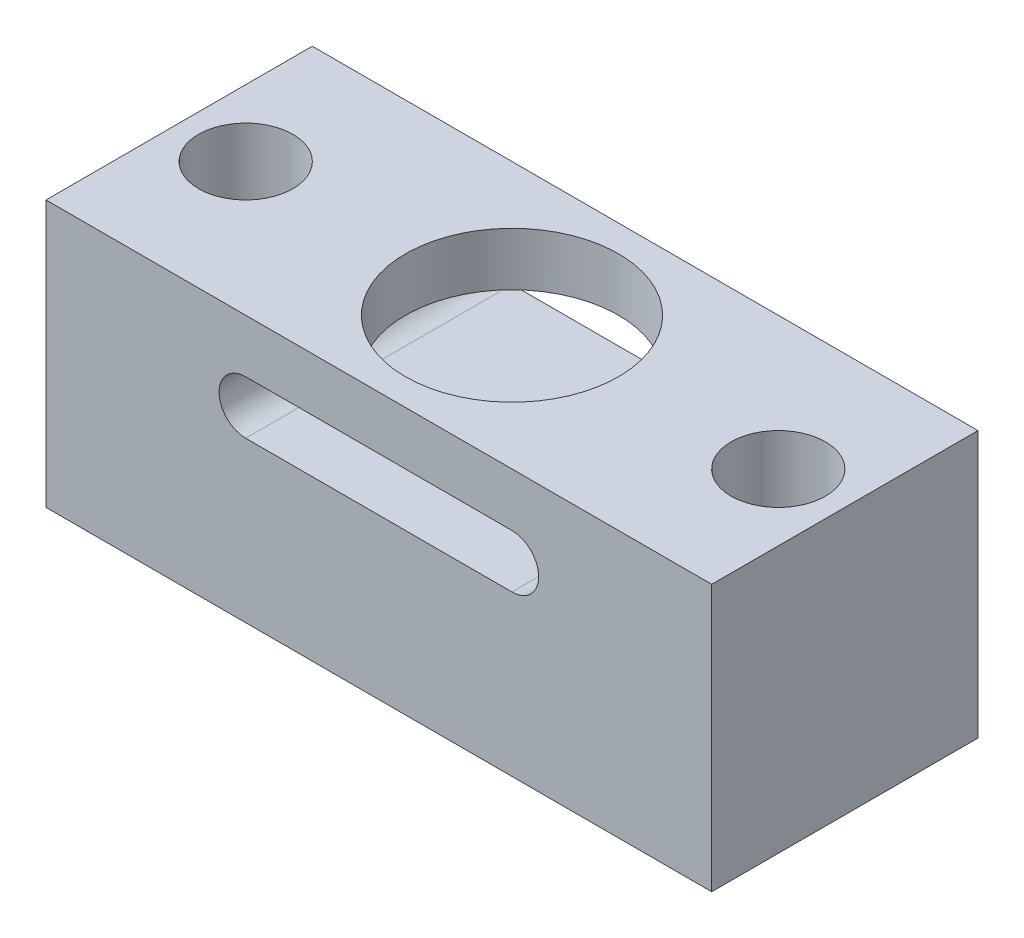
from build123d import *

# Parameters (mm, degrees)
SKETCH1_W                   = 25.4
SKETCH1_H                   = 12.7
BOSS_EXTRUDE1_DEPTH         = 12.7
SKETCH6_W                   = 12.7
SKETCH6_H                   = 12.7
BOSS_EXTRUDE2_DEPTH         = 6.35
SKETCH7_R                   = 5.08
CUT_EXTRUDE1_DEPTH          = 5.08
F_16_0_177_DIAMETER_HOLE1_D = 4.4958
CUT_EXTRUDE2_DEPTH          = 46.375688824


with BuildPart() as part:
    # Sketch1 → Boss-Extrude1 (new body)
    with BuildSketch(Plane(origin=(0, 0, 0), x_dir=(1, 0, 0), z_dir=(0, 1, 0))):
        with Locations((-22.61981085, 20.642176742)):
            Rectangle(SKETCH1_W, SKETCH1_H)
    extrude(amount=BOSS_EXTRUDE1_DEPTH)

    # Sketch6 → Boss-Extrude2 (add)
    with BuildSketch(Plane.ZY.offset(35.31981085)):
        with Locations((-20.642176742, 6.35)):
            Rectangle(SKETCH6_W, SKETCH6_H)
    extrude(amount=BOSS_EXTRUDE2_DEPTH)

    # Sketch7 → Cut-Extrude1 (cut)
    with BuildSketch(Plane(origin=(0, 12.7, 0), x_dir=(1, 0, 0), z_dir=(0, 1, 0))):
        with Locations(Location((-25.79481085, 20.642176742, 0), (0, 0, 270))):
            Circle(SKETCH7_R)
    extrude(amount=-CUT_EXTRUDE1_DEPTH, mode=Mode.SUBTRACT)

    # 16 _0.177_ Diameter Hole1 (through all)
    with Locations(Plane(origin=(0, 12.7, 0), x_dir=(1, 0, 0), z_dir=(0, 1, 0))):
        with Locations((-38.49481085, 20.642176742), (-13.09481085, 20.642176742)):
            Hole(F_16_0_177_DIAMETER_HOLE1_D / 2)

    # Sketch10 → Cut-Extrude2 (cut, through all)
    with BuildSketch(Plane.XY.offset(-14.292176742)):
        with BuildLine():
            Line((-32.14481085, 10.16), (-19.44481085, 10.16))
            ThreePointArc((-19.44481085, 10.16), (-18.17481085, 8.89), (-19.44481085, 7.62))
            Line((-19.44481085, 7.62), (-32.14481085, 7.62))
            ThreePointArc((-32.14481085, 7.62), (-33.41481085, 8.89), (-32.14481085, 10.16))
        make_face()
    extrude(amount=-CUT_EXTRUDE2_DEPTH, mode=Mode.SUBTRACT)


solid = part.part
